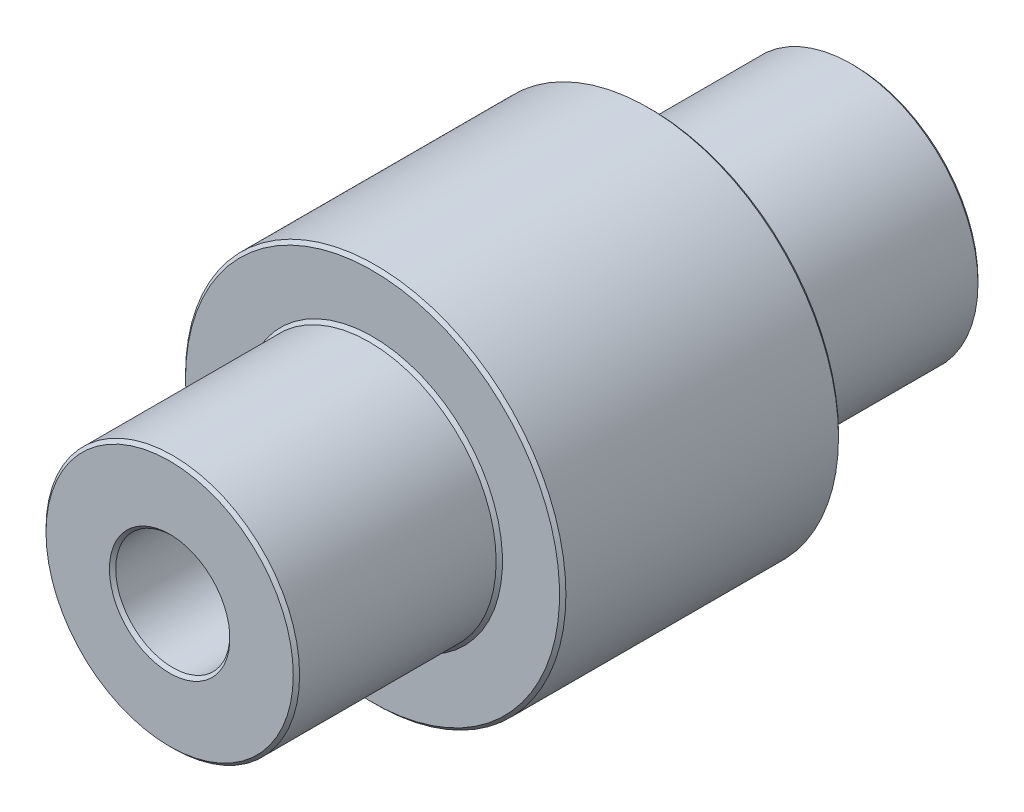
ISO-10303-21;
HEADER;
FILE_DESCRIPTION(('STEP AP214'),'2;1');
FILE_NAME('part.step','',(''),(''),'','','');
FILE_SCHEMA(('AUTOMOTIVE_DESIGN { 1 0 10303 214 1 1 1 1 }'));
ENDSEC;
DATA;
#1=APPLICATION_CONTEXT('core data for automotive mechanical design processes');
#2=APPLICATION_PROTOCOL_DEFINITION('international standard','automotive_design',2000,#1);
#3=PRODUCT_CONTEXT('',#1,'mechanical');
#4=PRODUCT('Part','Part','',(#3));
#5=PRODUCT_RELATED_PRODUCT_CATEGORY('part','',(#4));
#6=PRODUCT_DEFINITION_FORMATION('','',#4);
#7=PRODUCT_DEFINITION_CONTEXT('part definition',#1,'design');
#8=PRODUCT_DEFINITION('design','',#6,#7);
#9=PRODUCT_DEFINITION_SHAPE('','',#8);
#10=(LENGTH_UNIT() NAMED_UNIT(*) SI_UNIT(.MILLI.,.METRE.));
#11=(NAMED_UNIT(*) PLANE_ANGLE_UNIT() SI_UNIT($,.RADIAN.));
#12=(NAMED_UNIT(*) SI_UNIT($,.STERADIAN.) SOLID_ANGLE_UNIT());
#13=UNCERTAINTY_MEASURE_WITH_UNIT(LENGTH_MEASURE(1.E-05),#10,'distance_accuracy_value','');
#14=(GEOMETRIC_REPRESENTATION_CONTEXT(3) GLOBAL_UNCERTAINTY_ASSIGNED_CONTEXT((#13)) GLOBAL_UNIT_ASSIGNED_CONTEXT((#10,
#11,#12)) REPRESENTATION_CONTEXT('',''));
#15=CARTESIAN_POINT('',(0.,0.,0.));
#16=DIRECTION('',(0.,0.,1.));
#17=DIRECTION('',(1.,0.,0.));
#18=AXIS2_PLACEMENT_3D('',#15,#16,#17);
#19=CARTESIAN_POINT('',(0.,10.,27.));
#20=DIRECTION('',(0.,0.,-1.));
#21=DIRECTION('',(-1.,0.,0.));
#22=AXIS2_PLACEMENT_3D('',#19,#20,#21);
#23=PLANE('',#22);
#24=CARTESIAN_POINT('',(0.,0.,27.));
#25=DIRECTION('',(0.,0.,-1.));
#26=DIRECTION('',(-1.,0.,0.));
#27=AXIS2_PLACEMENT_3D('',#24,#25,#26);
#28=CIRCLE('',#27,9.75000000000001);
#29=CARTESIAN_POINT('',(-9.75000000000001,0.,27.));
#30=VERTEX_POINT('',#29);
#31=EDGE_CURVE('E40',#30,#30,#28,.F.);
#32=ORIENTED_EDGE('',*,*,#31,.T.);
#33=EDGE_LOOP('',(#32));
#34=FACE_BOUND('',#33,.T.);
#35=CARTESIAN_POINT('',(0.,0.,27.));
#36=DIRECTION('',(0.,0.,-1.));
#37=DIRECTION('',(-1.,0.,0.));
#38=AXIS2_PLACEMENT_3D('',#35,#36,#37);
#39=CIRCLE('',#38,4.75000000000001);
#40=CARTESIAN_POINT('',(-4.75000000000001,0.,27.));
#41=VERTEX_POINT('',#40);
#42=EDGE_CURVE('E44',#41,#41,#39,.T.);
#43=ORIENTED_EDGE('',*,*,#42,.T.);
#44=EDGE_LOOP('',(#43));
#45=FACE_BOUND('',#44,.T.);
#46=ADVANCED_FACE('F29',(#34,#45),#23,.F.);
#47=CARTESIAN_POINT('',(0.,0.,27.));
#48=DIRECTION('',(0.,0.,1.));
#49=DIRECTION('',(1.,0.,0.));
#50=AXIS2_PLACEMENT_3D('',#47,#48,#49);
#51=CYLINDRICAL_SURFACE('',#50,4.5);
#52=CARTESIAN_POINT('',(0.,0.,26.75));
#53=DIRECTION('',(0.,0.,-1.));
#54=DIRECTION('',(-1.,0.,0.));
#55=AXIS2_PLACEMENT_3D('',#52,#53,#54);
#56=CIRCLE('',#55,4.5);
#57=CARTESIAN_POINT('',(-4.5,0.,26.75));
#58=VERTEX_POINT('',#57);
#59=EDGE_CURVE('E10',#58,#58,#56,.F.);
#60=ORIENTED_EDGE('',*,*,#59,.T.);
#61=EDGE_LOOP('',(#60));
#62=FACE_BOUND('',#61,.T.);
#63=CARTESIAN_POINT('',(0.,0.,-26.75));
#64=DIRECTION('',(0.,0.,1.));
#65=DIRECTION('',(1.,0.,0.));
#66=AXIS2_PLACEMENT_3D('',#63,#64,#65);
#67=CIRCLE('',#66,4.5);
#68=CARTESIAN_POINT('',(4.5,0.,-26.75));
#69=VERTEX_POINT('',#68);
#70=EDGE_CURVE('E36',#69,#69,#67,.F.);
#71=ORIENTED_EDGE('',*,*,#70,.T.);
#72=EDGE_LOOP('',(#71));
#73=FACE_BOUND('',#72,.T.);
#74=ADVANCED_FACE('F124',(#62,#73),#51,.F.);
#75=CARTESIAN_POINT('',(0.,4.5,-27.));
#76=DIRECTION('',(0.,0.,1.));
#77=DIRECTION('',(1.,0.,0.));
#78=AXIS2_PLACEMENT_3D('',#75,#76,#77);
#79=PLANE('',#78);
#80=CARTESIAN_POINT('',(0.,0.,-27.));
#81=DIRECTION('',(0.,0.,1.));
#82=DIRECTION('',(1.,0.,0.));
#83=AXIS2_PLACEMENT_3D('',#80,#81,#82);
#84=CIRCLE('',#83,9.75);
#85=CARTESIAN_POINT('',(9.75,0.,-27.));
#86=VERTEX_POINT('',#85);
#87=EDGE_CURVE('E55',#86,#86,#84,.F.);
#88=ORIENTED_EDGE('',*,*,#87,.T.);
#89=EDGE_LOOP('',(#88));
#90=FACE_BOUND('',#89,.T.);
#91=CARTESIAN_POINT('',(0.,0.,-27.));
#92=DIRECTION('',(0.,0.,1.));
#93=DIRECTION('',(1.,0.,0.));
#94=AXIS2_PLACEMENT_3D('',#91,#92,#93);
#95=CIRCLE('',#94,4.74999999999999);
#96=CARTESIAN_POINT('',(4.74999999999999,0.,-27.));
#97=VERTEX_POINT('',#96);
#98=EDGE_CURVE('E58',#97,#97,#95,.T.);
#99=ORIENTED_EDGE('',*,*,#98,.T.);
#100=EDGE_LOOP('',(#99));
#101=FACE_BOUND('',#100,.T.);
#102=ADVANCED_FACE('F146',(#90,#101),#79,.F.);
#103=CARTESIAN_POINT('',(0.,0.,27.));
#104=DIRECTION('',(0.,0.,1.));
#105=DIRECTION('',(1.,0.,0.));
#106=AXIS2_PLACEMENT_3D('',#103,#104,#105);
#107=CYLINDRICAL_SURFACE('',#106,10.);
#108=CARTESIAN_POINT('',(0.,0.,-26.75));
#109=DIRECTION('',(0.,0.,1.));
#110=DIRECTION('',(1.,0.,0.));
#111=AXIS2_PLACEMENT_3D('',#108,#109,#110);
#112=CIRCLE('',#111,10.);
#113=CARTESIAN_POINT('',(10.,0.,-26.75));
#114=VERTEX_POINT('',#113);
#115=EDGE_CURVE('E61',#114,#114,#112,.T.);
#116=ORIENTED_EDGE('',*,*,#115,.T.);
#117=EDGE_LOOP('',(#116));
#118=FACE_BOUND('',#117,.T.);
#119=CARTESIAN_POINT('',(0.,0.,-11.25));
#120=DIRECTION('',(0.,0.,1.));
#121=DIRECTION('',(1.,0.,0.));
#122=AXIS2_PLACEMENT_3D('',#119,#120,#121);
#123=CIRCLE('',#122,10.);
#124=CARTESIAN_POINT('',(10.,0.,-11.25));
#125=VERTEX_POINT('',#124);
#126=EDGE_CURVE('E64',#125,#125,#123,.F.);
#127=ORIENTED_EDGE('',*,*,#126,.T.);
#128=EDGE_LOOP('',(#127));
#129=FACE_BOUND('',#128,.T.);
#130=ADVANCED_FACE('F149',(#118,#129),#107,.T.);
#131=CARTESIAN_POINT('',(0.,10.,-11.));
#132=DIRECTION('',(0.,0.,1.));
#133=DIRECTION('',(1.,0.,0.));
#134=AXIS2_PLACEMENT_3D('',#131,#132,#133);
#135=PLANE('',#134);
#136=CARTESIAN_POINT('',(0.,0.,-11.));
#137=DIRECTION('',(0.,0.,1.));
#138=DIRECTION('',(1.,0.,0.));
#139=AXIS2_PLACEMENT_3D('',#136,#137,#138);
#140=CIRCLE('',#139,14.75);
#141=CARTESIAN_POINT('',(14.75,0.,-11.));
#142=VERTEX_POINT('',#141);
#143=EDGE_CURVE('E73',#142,#142,#140,.F.);
#144=ORIENTED_EDGE('',*,*,#143,.T.);
#145=EDGE_LOOP('',(#144));
#146=FACE_BOUND('',#145,.T.);
#147=CARTESIAN_POINT('',(0.,0.,-11.));
#148=DIRECTION('',(0.,0.,1.));
#149=DIRECTION('',(1.,0.,0.));
#150=AXIS2_PLACEMENT_3D('',#147,#148,#149);
#151=CIRCLE('',#150,10.25);
#152=CARTESIAN_POINT('',(10.25,0.,-11.));
#153=VERTEX_POINT('',#152);
#154=EDGE_CURVE('E76',#153,#153,#151,.T.);
#155=ORIENTED_EDGE('',*,*,#154,.T.);
#156=EDGE_LOOP('',(#155));
#157=FACE_BOUND('',#156,.T.);
#158=ADVANCED_FACE('F153',(#146,#157),#135,.F.);
#159=CARTESIAN_POINT('',(0.,0.,27.));
#160=DIRECTION('',(0.,0.,1.));
#161=DIRECTION('',(1.,0.,0.));
#162=AXIS2_PLACEMENT_3D('',#159,#160,#161);
#163=CYLINDRICAL_SURFACE('',#162,15.);
#164=CARTESIAN_POINT('',(0.,0.,-10.75));
#165=DIRECTION('',(0.,0.,1.));
#166=DIRECTION('',(1.,0.,0.));
#167=AXIS2_PLACEMENT_3D('',#164,#165,#166);
#168=CIRCLE('',#167,15.);
#169=CARTESIAN_POINT('',(15.,0.,-10.75));
#170=VERTEX_POINT('',#169);
#171=EDGE_CURVE('E79',#170,#170,#168,.T.);
#172=ORIENTED_EDGE('',*,*,#171,.T.);
#173=EDGE_LOOP('',(#172));
#174=FACE_BOUND('',#173,.T.);
#175=CARTESIAN_POINT('',(0.,0.,10.75));
#176=DIRECTION('',(0.,0.,-1.));
#177=DIRECTION('',(-1.,0.,0.));
#178=AXIS2_PLACEMENT_3D('',#175,#176,#177);
#179=CIRCLE('',#178,15.);
#180=CARTESIAN_POINT('',(-15.,0.,10.75));
#181=VERTEX_POINT('',#180);
#182=EDGE_CURVE('E82',#181,#181,#179,.T.);
#183=ORIENTED_EDGE('',*,*,#182,.T.);
#184=EDGE_LOOP('',(#183));
#185=FACE_BOUND('',#184,.T.);
#186=ADVANCED_FACE('F86',(#174,#185),#163,.T.);
#187=CARTESIAN_POINT('',(0.,15.,11.));
#188=DIRECTION('',(0.,0.,-1.));
#189=DIRECTION('',(-1.,0.,0.));
#190=AXIS2_PLACEMENT_3D('',#187,#188,#189);
#191=PLANE('',#190);
#192=CARTESIAN_POINT('',(0.,0.,11.));
#193=DIRECTION('',(0.,0.,-1.));
#194=DIRECTION('',(-1.,0.,0.));
#195=AXIS2_PLACEMENT_3D('',#192,#193,#194);
#196=CIRCLE('',#195,14.75);
#197=CARTESIAN_POINT('',(-14.75,0.,11.));
#198=VERTEX_POINT('',#197);
#199=EDGE_CURVE('E67',#198,#198,#196,.F.);
#200=ORIENTED_EDGE('',*,*,#199,.T.);
#201=EDGE_LOOP('',(#200));
#202=FACE_BOUND('',#201,.T.);
#203=CARTESIAN_POINT('',(0.,0.,11.));
#204=DIRECTION('',(0.,0.,-1.));
#205=DIRECTION('',(-1.,0.,0.));
#206=AXIS2_PLACEMENT_3D('',#203,#204,#205);
#207=CIRCLE('',#206,10.25);
#208=CARTESIAN_POINT('',(-10.25,0.,11.));
#209=VERTEX_POINT('',#208);
#210=EDGE_CURVE('E70',#209,#209,#207,.T.);
#211=ORIENTED_EDGE('',*,*,#210,.T.);
#212=EDGE_LOOP('',(#211));
#213=FACE_BOUND('',#212,.T.);
#214=ADVANCED_FACE('F96',(#202,#213),#191,.F.);
#215=CARTESIAN_POINT('',(0.,0.,27.));
#216=DIRECTION('',(0.,0.,1.));
#217=DIRECTION('',(1.,0.,0.));
#218=AXIS2_PLACEMENT_3D('',#215,#216,#217);
#219=CYLINDRICAL_SURFACE('',#218,10.);
#220=CARTESIAN_POINT('',(0.,0.,11.25));
#221=DIRECTION('',(0.,0.,-1.));
#222=DIRECTION('',(-1.,0.,0.));
#223=AXIS2_PLACEMENT_3D('',#220,#221,#222);
#224=CIRCLE('',#223,10.);
#225=CARTESIAN_POINT('',(-10.,0.,11.25));
#226=VERTEX_POINT('',#225);
#227=EDGE_CURVE('E49',#226,#226,#224,.F.);
#228=ORIENTED_EDGE('',*,*,#227,.T.);
#229=EDGE_LOOP('',(#228));
#230=FACE_BOUND('',#229,.T.);
#231=CARTESIAN_POINT('',(0.,0.,26.75));
#232=DIRECTION('',(0.,0.,-1.));
#233=DIRECTION('',(-1.,0.,0.));
#234=AXIS2_PLACEMENT_3D('',#231,#232,#233);
#235=CIRCLE('',#234,10.);
#236=CARTESIAN_POINT('',(-10.,0.,26.75));
#237=VERTEX_POINT('',#236);
#238=EDGE_CURVE('E52',#237,#237,#235,.T.);
#239=ORIENTED_EDGE('',*,*,#238,.T.);
#240=EDGE_LOOP('',(#239));
#241=FACE_BOUND('',#240,.T.);
#242=ADVANCED_FACE('F99',(#230,#241),#219,.T.);
#243=CARTESIAN_POINT('',(0.,0.,-10.75));
#244=DIRECTION('',(0.,0.,1.));
#245=DIRECTION('',(1.,0.,0.));
#246=AXIS2_PLACEMENT_3D('',#243,#244,#245);
#247=CONICAL_SURFACE('',#246,15.,0.785398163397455);
#248=ORIENTED_EDGE('',*,*,#143,.F.);
#249=EDGE_LOOP('',(#248));
#250=FACE_BOUND('',#249,.T.);
#251=ORIENTED_EDGE('',*,*,#171,.F.);
#252=EDGE_LOOP('',(#251));
#253=FACE_BOUND('',#252,.T.);
#254=ADVANCED_FACE('F92',(#250,#253),#247,.T.);
#255=CARTESIAN_POINT('',(0.,0.,11.));
#256=DIRECTION('',(0.,0.,-1.));
#257=DIRECTION('',(-1.,0.,0.));
#258=AXIS2_PLACEMENT_3D('',#255,#256,#257);
#259=CONICAL_SURFACE('',#258,14.75,0.785398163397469);
#260=ORIENTED_EDGE('',*,*,#182,.F.);
#261=EDGE_LOOP('',(#260));
#262=FACE_BOUND('',#261,.T.);
#263=ORIENTED_EDGE('',*,*,#199,.F.);
#264=EDGE_LOOP('',(#263));
#265=FACE_BOUND('',#264,.T.);
#266=ADVANCED_FACE('F88',(#262,#265),#259,.T.);
#267=CARTESIAN_POINT('',(0.,0.,-26.75));
#268=DIRECTION('',(0.,0.,1.));
#269=DIRECTION('',(1.,0.,0.));
#270=AXIS2_PLACEMENT_3D('',#267,#268,#269);
#271=CONICAL_SURFACE('',#270,10.,0.785398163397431);
#272=ORIENTED_EDGE('',*,*,#87,.F.);
#273=EDGE_LOOP('',(#272));
#274=FACE_BOUND('',#273,.T.);
#275=ORIENTED_EDGE('',*,*,#115,.F.);
#276=EDGE_LOOP('',(#275));
#277=FACE_BOUND('',#276,.T.);
#278=ADVANCED_FACE('F91',(#274,#277),#271,.T.);
#279=CARTESIAN_POINT('',(0.,0.,-11.));
#280=DIRECTION('',(0.,0.,1.));
#281=DIRECTION('',(1.,0.,0.));
#282=AXIS2_PLACEMENT_3D('',#279,#280,#281);
#283=CONICAL_SURFACE('',#282,10.25,0.785398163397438);
#284=ORIENTED_EDGE('',*,*,#126,.F.);
#285=EDGE_LOOP('',(#284));
#286=FACE_BOUND('',#285,.T.);
#287=ORIENTED_EDGE('',*,*,#154,.F.);
#288=EDGE_LOOP('',(#287));
#289=FACE_BOUND('',#288,.T.);
#290=ADVANCED_FACE('F107',(#286,#289),#283,.T.);
#291=CARTESIAN_POINT('',(0.,0.,11.25));
#292=DIRECTION('',(0.,0.,-1.));
#293=DIRECTION('',(-1.,0.,0.));
#294=AXIS2_PLACEMENT_3D('',#291,#292,#293);
#295=CONICAL_SURFACE('',#294,10.,0.785398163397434);
#296=ORIENTED_EDGE('',*,*,#210,.F.);
#297=EDGE_LOOP('',(#296));
#298=FACE_BOUND('',#297,.T.);
#299=ORIENTED_EDGE('',*,*,#227,.F.);
#300=EDGE_LOOP('',(#299));
#301=FACE_BOUND('',#300,.T.);
#302=ADVANCED_FACE('F103',(#298,#301),#295,.T.);
#303=CARTESIAN_POINT('',(0.,0.,27.));
#304=DIRECTION('',(0.,0.,-1.));
#305=DIRECTION('',(-1.,0.,0.));
#306=AXIS2_PLACEMENT_3D('',#303,#304,#305);
#307=CONICAL_SURFACE('',#306,9.75000000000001,0.785398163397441);
#308=ORIENTED_EDGE('',*,*,#238,.F.);
#309=EDGE_LOOP('',(#308));
#310=FACE_BOUND('',#309,.T.);
#311=ORIENTED_EDGE('',*,*,#31,.F.);
#312=EDGE_LOOP('',(#311));
#313=FACE_BOUND('',#312,.T.);
#314=ADVANCED_FACE('F106',(#310,#313),#307,.T.);
#315=CARTESIAN_POINT('',(0.,0.,26.75));
#316=DIRECTION('',(0.,0.,1.));
#317=DIRECTION('',(1.,0.,0.));
#318=AXIS2_PLACEMENT_3D('',#315,#316,#317);
#319=CONICAL_SURFACE('',#318,4.5,0.785398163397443);
#320=ORIENTED_EDGE('',*,*,#42,.F.);
#321=EDGE_LOOP('',(#320));
#322=FACE_BOUND('',#321,.T.);
#323=ORIENTED_EDGE('',*,*,#59,.F.);
#324=EDGE_LOOP('',(#323));
#325=FACE_BOUND('',#324,.T.);
#326=ADVANCED_FACE('F118',(#322,#325),#319,.F.);
#327=CARTESIAN_POINT('',(0.,0.,-27.));
#328=DIRECTION('',(0.,0.,-1.));
#329=DIRECTION('',(-1.,0.,0.));
#330=AXIS2_PLACEMENT_3D('',#327,#328,#329);
#331=CONICAL_SURFACE('',#330,4.75,0.785398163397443);
#332=ORIENTED_EDGE('',*,*,#70,.F.);
#333=EDGE_LOOP('',(#332));
#334=FACE_BOUND('',#333,.T.);
#335=ORIENTED_EDGE('',*,*,#98,.F.);
#336=EDGE_LOOP('',(#335));
#337=FACE_BOUND('',#336,.T.);
#338=ADVANCED_FACE('F31',(#334,#337),#331,.F.);
#339=CLOSED_SHELL('',(#46,#74,#102,#130,#158,#186,#214,#242,#254,#266,#278,#290,#302,#314,#326,#338));
#340=MANIFOLD_SOLID_BREP('B2',#339);
#341=ADVANCED_BREP_SHAPE_REPRESENTATION('',(#18,#340),#14);
#342=SHAPE_DEFINITION_REPRESENTATION(#9,#341);
ENDSEC;
END-ISO-10303-21;
